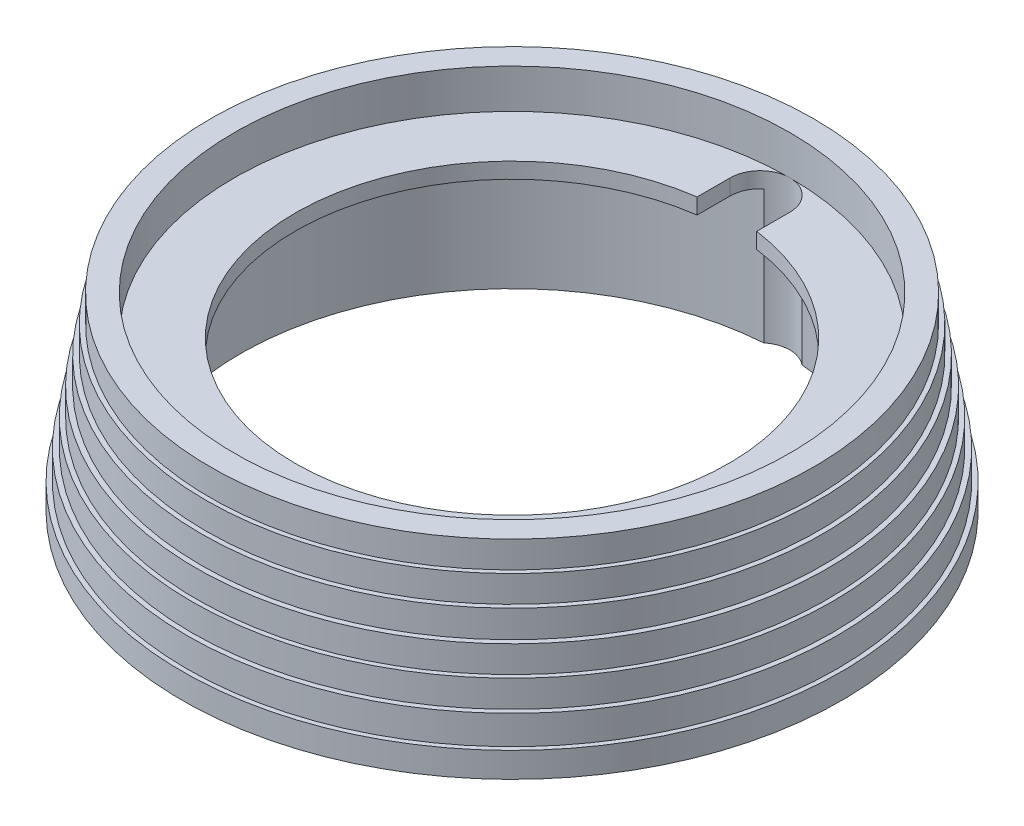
from build123d import *

# Parameters (mm, degrees)
SKETCH3_R          = 21.971
CUT_EXTRUDE2_DEPTH = 10.795
CUT_EXTRUDE3_DEPTH = 12.192


with BuildPart() as part:
    # Sketch1 → Revolve1 (revolve)
    with BuildSketch(Plane.XY, mode=Mode.PRIVATE) as revolve1_sk:
        Polygon((17.5514, 0), (17.5514, 12.065), (22.479, 12.065), (22.479, 15.24), (24.4094, 15.24), (24.4094, 13.081), (24.765, 13.081), (24.765, 10.922), (25.146, 10.922), (25.146, 8.7122), (25.5524, 8.7122), (25.5524, 6.5532), (25.908, 6.5532), (25.908, 4.3688), (26.3017, 4.3688), (26.3017, 2.032), (26.67, 2.032), (26.67, 0), align=None)
    revolve(revolve1_sk.sketch.rotate(Axis((0, 0, 0), (0, 1, 0)), 90), axis=Axis((0, 0, 0), (0, 1, 0)))

    # Sketch3 → Cut-Extrude2 (cut)
    with BuildSketch(Plane.XZ):
        with Locations(Location((0, 0, 0), (0, 0, 270))):
            Circle(SKETCH3_R)
    extrude(amount=-CUT_EXTRUDE2_DEPTH, mode=Mode.SUBTRACT)

    # Sketch4 → Cut-Extrude3 (cut)
    with BuildSketch(Plane(origin=(0, 12.065, 0), x_dir=(1, 0, 0), z_dir=(0, 1, 0))):
        with BuildLine():
            Line((2.413, 20.066), (2.413, 15.290712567))
            Line((2.413, 15.290712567), (-2.413, 15.290712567))
            Line((-2.413, 15.290712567), (-2.413, 20.066))
            ThreePointArc((-2.413, 20.066), (0, 22.479), (2.413, 20.066))
        make_face()
    extrude(amount=-CUT_EXTRUDE3_DEPTH, mode=Mode.SUBTRACT)


solid = part.part
